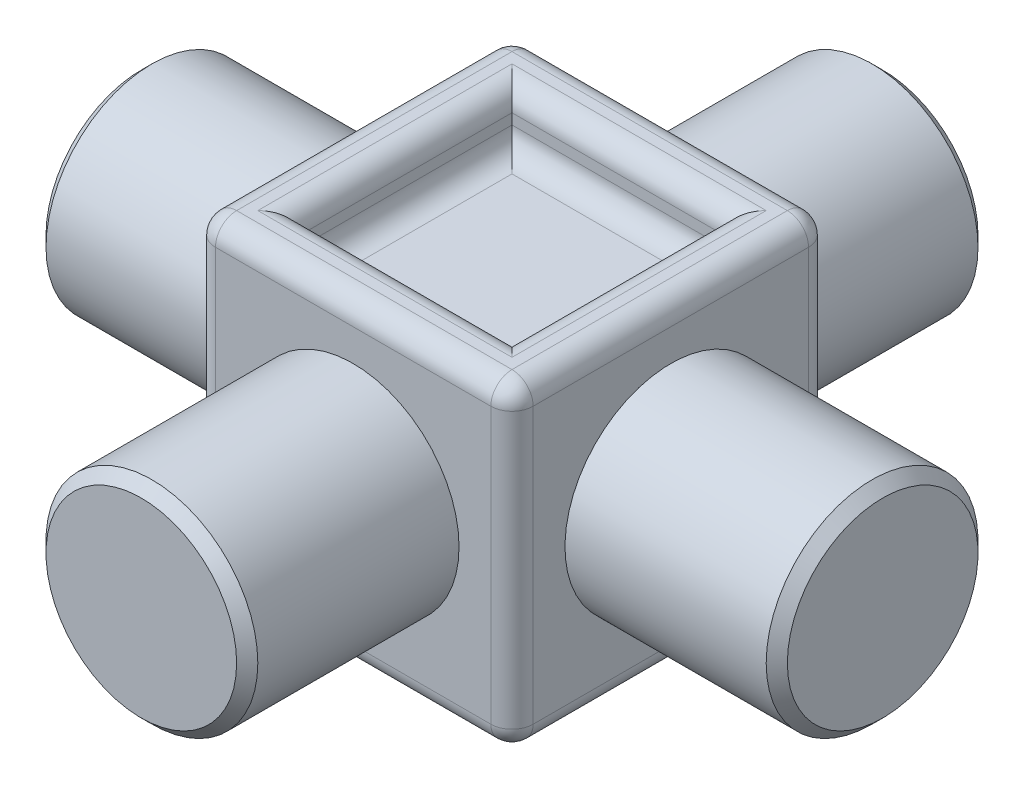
ISO-10303-21;
HEADER;
FILE_DESCRIPTION(('STEP AP214'),'2;1');
FILE_NAME('part.step','',(''),(''),'','','');
FILE_SCHEMA(('AUTOMOTIVE_DESIGN { 1 0 10303 214 1 1 1 1 }'));
ENDSEC;
DATA;
#1=APPLICATION_CONTEXT('core data for automotive mechanical design processes');
#2=APPLICATION_PROTOCOL_DEFINITION('international standard','automotive_design',2000,#1);
#3=PRODUCT_CONTEXT('',#1,'mechanical');
#4=PRODUCT('Part','Part','',(#3));
#5=PRODUCT_RELATED_PRODUCT_CATEGORY('part','',(#4));
#6=PRODUCT_DEFINITION_FORMATION('','',#4);
#7=PRODUCT_DEFINITION_CONTEXT('part definition',#1,'design');
#8=PRODUCT_DEFINITION('design','',#6,#7);
#9=PRODUCT_DEFINITION_SHAPE('','',#8);
#10=(LENGTH_UNIT() NAMED_UNIT(*) SI_UNIT(.MILLI.,.METRE.));
#11=(NAMED_UNIT(*) PLANE_ANGLE_UNIT() SI_UNIT($,.RADIAN.));
#12=(NAMED_UNIT(*) SI_UNIT($,.STERADIAN.) SOLID_ANGLE_UNIT());
#13=UNCERTAINTY_MEASURE_WITH_UNIT(LENGTH_MEASURE(1.E-05),#10,'distance_accuracy_value','');
#14=(GEOMETRIC_REPRESENTATION_CONTEXT(3) GLOBAL_UNCERTAINTY_ASSIGNED_CONTEXT((#13)) GLOBAL_UNIT_ASSIGNED_CONTEXT((#10,
#11,#12)) REPRESENTATION_CONTEXT('',''));
#15=CARTESIAN_POINT('',(0.,0.,0.));
#16=DIRECTION('',(0.,0.,1.));
#17=DIRECTION('',(1.,0.,0.));
#18=AXIS2_PLACEMENT_3D('',#15,#16,#17);
#19=CARTESIAN_POINT('',(-15.,15.,15.));
#20=DIRECTION('',(1.,0.,0.));
#21=DIRECTION('',(0.,1.,0.));
#22=AXIS2_PLACEMENT_3D('',#19,#20,#21);
#23=PLANE('',#22);
#24=CARTESIAN_POINT('',(-15.,0.,0.));
#25=DIRECTION('',(1.,0.,0.));
#26=DIRECTION('',(0.,1.,0.));
#27=AXIS2_PLACEMENT_3D('',#24,#25,#26);
#28=CIRCLE('',#27,10.);
#29=CARTESIAN_POINT('',(-15.,10.,0.));
#30=VERTEX_POINT('',#29);
#31=EDGE_CURVE('E243',#30,#30,#28,.F.);
#32=ORIENTED_EDGE('',*,*,#31,.F.);
#33=EDGE_LOOP('',(#32));
#34=FACE_BOUND('',#33,.T.);
#35=DIRECTION('',(0.,0.,-1.));
#36=VECTOR('',#35,1.);
#37=CARTESIAN_POINT('',(-15.,-13.,15.));
#38=LINE('',#37,#36);
#39=CARTESIAN_POINT('',(-15.,-13.,-13.));
#40=VERTEX_POINT('',#39);
#41=CARTESIAN_POINT('',(-15.,-13.,13.));
#42=VERTEX_POINT('',#41);
#43=EDGE_CURVE('E276',#40,#42,#38,.F.);
#44=ORIENTED_EDGE('',*,*,#43,.T.);
#45=DIRECTION('',(0.,-1.,0.));
#46=VECTOR('',#45,1.);
#47=CARTESIAN_POINT('',(-15.,13.,13.));
#48=LINE('',#47,#46);
#49=CARTESIAN_POINT('',(-15.,13.,13.));
#50=VERTEX_POINT('',#49);
#51=EDGE_CURVE('E436',#42,#50,#48,.F.);
#52=ORIENTED_EDGE('',*,*,#51,.T.);
#53=DIRECTION('',(0.,0.,-1.));
#54=VECTOR('',#53,1.);
#55=CARTESIAN_POINT('',(-15.,13.,15.));
#56=LINE('',#55,#54);
#57=CARTESIAN_POINT('',(-15.,13.,-13.));
#58=VERTEX_POINT('',#57);
#59=EDGE_CURVE('E279',#50,#58,#56,.T.);
#60=ORIENTED_EDGE('',*,*,#59,.T.);
#61=DIRECTION('',(0.,-1.,0.));
#62=VECTOR('',#61,1.);
#63=CARTESIAN_POINT('',(-15.,15.,-13.));
#64=LINE('',#63,#62);
#65=EDGE_CURVE('E434',#58,#40,#64,.T.);
#66=ORIENTED_EDGE('',*,*,#65,.T.);
#67=EDGE_LOOP('',(#44,#52,#60,#66));
#68=FACE_BOUND('',#67,.T.);
#69=ADVANCED_FACE('F34',(#34,#68),#23,.F.);
#70=CARTESIAN_POINT('',(-15.,-15.,15.));
#71=DIRECTION('',(0.,1.,0.));
#72=DIRECTION('',(0.,0.,1.));
#73=AXIS2_PLACEMENT_3D('',#70,#71,#72);
#74=PLANE('',#73);
#75=DIRECTION('',(1.,0.,0.));
#76=VECTOR('',#75,1.);
#77=CARTESIAN_POINT('',(-15.,-15.,13.));
#78=LINE('',#77,#76);
#79=CARTESIAN_POINT('',(13.,-15.,13.));
#80=VERTEX_POINT('',#79);
#81=CARTESIAN_POINT('',(-13.,-15.,13.));
#82=VERTEX_POINT('',#81);
#83=EDGE_CURVE('E326',#80,#82,#78,.F.);
#84=ORIENTED_EDGE('',*,*,#83,.T.);
#85=DIRECTION('',(0.,0.,-1.));
#86=VECTOR('',#85,1.);
#87=CARTESIAN_POINT('',(-13.,-15.,15.));
#88=LINE('',#87,#86);
#89=CARTESIAN_POINT('',(-13.,-15.,-13.));
#90=VERTEX_POINT('',#89);
#91=EDGE_CURVE('E329',#82,#90,#88,.T.);
#92=ORIENTED_EDGE('',*,*,#91,.T.);
#93=DIRECTION('',(1.,0.,0.));
#94=VECTOR('',#93,1.);
#95=CARTESIAN_POINT('',(-15.,-15.,-13.));
#96=LINE('',#95,#94);
#97=CARTESIAN_POINT('',(13.,-15.,-13.));
#98=VERTEX_POINT('',#97);
#99=EDGE_CURVE('E320',#90,#98,#96,.T.);
#100=ORIENTED_EDGE('',*,*,#99,.T.);
#101=DIRECTION('',(0.,0.,-1.));
#102=VECTOR('',#101,1.);
#103=CARTESIAN_POINT('',(13.,-15.,15.));
#104=LINE('',#103,#102);
#105=EDGE_CURVE('E323',#98,#80,#104,.F.);
#106=ORIENTED_EDGE('',*,*,#105,.T.);
#107=EDGE_LOOP('',(#84,#92,#100,#106));
#108=FACE_BOUND('',#107,.T.);
#109=DIRECTION('',(-1.,0.,0.));
#110=VECTOR('',#109,1.);
#111=CARTESIAN_POINT('',(-15.,-15.,12.));
#112=LINE('',#111,#110);
#113=CARTESIAN_POINT('',(-12.,-15.,12.));
#114=VERTEX_POINT('',#113);
#115=CARTESIAN_POINT('',(12.,-15.,12.));
#116=VERTEX_POINT('',#115);
#117=EDGE_CURVE('E315',#114,#116,#112,.F.);
#118=ORIENTED_EDGE('',*,*,#117,.T.);
#119=DIRECTION('',(0.,0.,1.));
#120=VECTOR('',#119,1.);
#121=CARTESIAN_POINT('',(12.,-15.,15.));
#122=LINE('',#121,#120);
#123=CARTESIAN_POINT('',(12.,-15.,-12.));
#124=VERTEX_POINT('',#123);
#125=EDGE_CURVE('E317',#116,#124,#122,.F.);
#126=ORIENTED_EDGE('',*,*,#125,.T.);
#127=DIRECTION('',(1.,0.,0.));
#128=VECTOR('',#127,1.);
#129=CARTESIAN_POINT('',(-15.,-15.,-12.));
#130=LINE('',#129,#128);
#131=CARTESIAN_POINT('',(-12.,-15.,-12.));
#132=VERTEX_POINT('',#131);
#133=EDGE_CURVE('E311',#124,#132,#130,.F.);
#134=ORIENTED_EDGE('',*,*,#133,.T.);
#135=DIRECTION('',(0.,0.,-1.));
#136=VECTOR('',#135,1.);
#137=CARTESIAN_POINT('',(-12.,-15.,15.));
#138=LINE('',#137,#136);
#139=EDGE_CURVE('E313',#132,#114,#138,.F.);
#140=ORIENTED_EDGE('',*,*,#139,.T.);
#141=EDGE_LOOP('',(#118,#126,#134,#140));
#142=FACE_BOUND('',#141,.T.);
#143=ADVANCED_FACE('F498',(#108,#142),#74,.F.);
#144=CARTESIAN_POINT('',(15.,15.,15.));
#145=DIRECTION('',(-1.,0.,0.));
#146=DIRECTION('',(0.,-1.,0.));
#147=AXIS2_PLACEMENT_3D('',#144,#145,#146);
#148=PLANE('',#147);
#149=CARTESIAN_POINT('',(15.,0.,0.));
#150=DIRECTION('',(-1.,0.,0.));
#151=DIRECTION('',(0.,-1.,0.));
#152=AXIS2_PLACEMENT_3D('',#149,#150,#151);
#153=CIRCLE('',#152,10.);
#154=CARTESIAN_POINT('',(15.,-10.,0.));
#155=VERTEX_POINT('',#154);
#156=EDGE_CURVE('E702',#155,#155,#153,.F.);
#157=ORIENTED_EDGE('',*,*,#156,.F.);
#158=EDGE_LOOP('',(#157));
#159=FACE_BOUND('',#158,.T.);
#160=DIRECTION('',(0.,0.,-1.));
#161=VECTOR('',#160,1.);
#162=CARTESIAN_POINT('',(15.,13.,15.));
#163=LINE('',#162,#161);
#164=CARTESIAN_POINT('',(15.,13.,-13.));
#165=VERTEX_POINT('',#164);
#166=CARTESIAN_POINT('',(15.,13.,13.));
#167=VERTEX_POINT('',#166);
#168=EDGE_CURVE('E267',#165,#167,#163,.F.);
#169=ORIENTED_EDGE('',*,*,#168,.T.);
#170=DIRECTION('',(0.,1.,0.));
#171=VECTOR('',#170,1.);
#172=CARTESIAN_POINT('',(15.,-13.,13.));
#173=LINE('',#172,#171);
#174=CARTESIAN_POINT('',(15.,-13.,13.));
#175=VERTEX_POINT('',#174);
#176=EDGE_CURVE('E440',#167,#175,#173,.F.);
#177=ORIENTED_EDGE('',*,*,#176,.T.);
#178=DIRECTION('',(0.,0.,-1.));
#179=VECTOR('',#178,1.);
#180=CARTESIAN_POINT('',(15.,-13.,15.));
#181=LINE('',#180,#179);
#182=CARTESIAN_POINT('',(15.,-13.,-13.));
#183=VERTEX_POINT('',#182);
#184=EDGE_CURVE('E264',#175,#183,#181,.T.);
#185=ORIENTED_EDGE('',*,*,#184,.T.);
#186=DIRECTION('',(0.,1.,0.));
#187=VECTOR('',#186,1.);
#188=CARTESIAN_POINT('',(15.,15.,-13.));
#189=LINE('',#188,#187);
#190=EDGE_CURVE('E438',#183,#165,#189,.T.);
#191=ORIENTED_EDGE('',*,*,#190,.T.);
#192=EDGE_LOOP('',(#169,#177,#185,#191));
#193=FACE_BOUND('',#192,.T.);
#194=ADVANCED_FACE('F504',(#159,#193),#148,.F.);
#195=CARTESIAN_POINT('',(-15.,15.,15.));
#196=DIRECTION('',(0.,-1.,0.));
#197=DIRECTION('',(0.,0.,-1.));
#198=AXIS2_PLACEMENT_3D('',#195,#196,#197);
#199=PLANE('',#198);
#200=DIRECTION('',(-1.,0.,0.));
#201=VECTOR('',#200,1.);
#202=CARTESIAN_POINT('',(15.,15.,13.));
#203=LINE('',#202,#201);
#204=CARTESIAN_POINT('',(-13.,15.,13.));
#205=VERTEX_POINT('',#204);
#206=CARTESIAN_POINT('',(13.,15.,13.));
#207=VERTEX_POINT('',#206);
#208=EDGE_CURVE('E258',#205,#207,#203,.F.);
#209=ORIENTED_EDGE('',*,*,#208,.T.);
#210=DIRECTION('',(0.,0.,-1.));
#211=VECTOR('',#210,1.);
#212=CARTESIAN_POINT('',(13.,15.,15.));
#213=LINE('',#212,#211);
#214=CARTESIAN_POINT('',(13.,15.,-13.));
#215=VERTEX_POINT('',#214);
#216=EDGE_CURVE('E261',#207,#215,#213,.T.);
#217=ORIENTED_EDGE('',*,*,#216,.T.);
#218=DIRECTION('',(-1.,0.,0.));
#219=VECTOR('',#218,1.);
#220=CARTESIAN_POINT('',(-15.,15.,-13.));
#221=LINE('',#220,#219);
#222=CARTESIAN_POINT('',(-13.,15.,-13.));
#223=VERTEX_POINT('',#222);
#224=EDGE_CURVE('E248',#215,#223,#221,.T.);
#225=ORIENTED_EDGE('',*,*,#224,.T.);
#226=DIRECTION('',(0.,0.,-1.));
#227=VECTOR('',#226,1.);
#228=CARTESIAN_POINT('',(-13.,15.,15.));
#229=LINE('',#228,#227);
#230=EDGE_CURVE('E251',#223,#205,#229,.F.);
#231=ORIENTED_EDGE('',*,*,#230,.T.);
#232=EDGE_LOOP('',(#209,#217,#225,#231));
#233=FACE_BOUND('',#232,.T.);
#234=DIRECTION('',(1.,0.,0.));
#235=VECTOR('',#234,1.);
#236=CARTESIAN_POINT('',(-15.,15.,12.));
#237=LINE('',#236,#235);
#238=CARTESIAN_POINT('',(12.,15.,12.));
#239=VERTEX_POINT('',#238);
#240=CARTESIAN_POINT('',(-12.,15.,12.));
#241=VERTEX_POINT('',#240);
#242=EDGE_CURVE('E247',#239,#241,#237,.F.);
#243=ORIENTED_EDGE('',*,*,#242,.T.);
#244=DIRECTION('',(0.,0.,1.));
#245=VECTOR('',#244,1.);
#246=CARTESIAN_POINT('',(-12.,15.,15.));
#247=LINE('',#246,#245);
#248=CARTESIAN_POINT('',(-12.,15.,-12.));
#249=VERTEX_POINT('',#248);
#250=EDGE_CURVE('E226',#241,#249,#247,.F.);
#251=ORIENTED_EDGE('',*,*,#250,.T.);
#252=DIRECTION('',(-1.,0.,0.));
#253=VECTOR('',#252,1.);
#254=CARTESIAN_POINT('',(-15.,15.,-12.));
#255=LINE('',#254,#253);
#256=CARTESIAN_POINT('',(12.,15.,-12.));
#257=VERTEX_POINT('',#256);
#258=EDGE_CURVE('E236',#249,#257,#255,.F.);
#259=ORIENTED_EDGE('',*,*,#258,.T.);
#260=DIRECTION('',(0.,0.,-1.));
#261=VECTOR('',#260,1.);
#262=CARTESIAN_POINT('',(12.,15.,15.));
#263=LINE('',#262,#261);
#264=EDGE_CURVE('E242',#257,#239,#263,.F.);
#265=ORIENTED_EDGE('',*,*,#264,.T.);
#266=EDGE_LOOP('',(#243,#251,#259,#265));
#267=FACE_BOUND('',#266,.T.);
#268=ADVANCED_FACE('F245',(#233,#267),#199,.F.);
#269=CARTESIAN_POINT('',(0.,0.,15.));
#270=DIRECTION('',(0.,0.,1.));
#271=DIRECTION('',(1.,0.,0.));
#272=AXIS2_PLACEMENT_3D('',#269,#270,#271);
#273=PLANE('',#272);
#274=CARTESIAN_POINT('',(0.,0.,15.));
#275=DIRECTION('',(0.,0.,1.));
#276=DIRECTION('',(1.,0.,0.));
#277=AXIS2_PLACEMENT_3D('',#274,#275,#276);
#278=CIRCLE('',#277,10.);
#279=CARTESIAN_POINT('',(10.,0.,15.));
#280=VERTEX_POINT('',#279);
#281=EDGE_CURVE('E780',#280,#280,#278,.F.);
#282=ORIENTED_EDGE('',*,*,#281,.T.);
#283=EDGE_LOOP('',(#282));
#284=FACE_BOUND('',#283,.T.);
#285=DIRECTION('',(-1.,0.,0.));
#286=VECTOR('',#285,1.);
#287=CARTESIAN_POINT('',(-15.,13.,15.));
#288=LINE('',#287,#286);
#289=CARTESIAN_POINT('',(13.,13.,15.));
#290=VERTEX_POINT('',#289);
#291=CARTESIAN_POINT('',(-13.,13.,15.));
#292=VERTEX_POINT('',#291);
#293=EDGE_CURVE('E273',#290,#292,#288,.T.);
#294=ORIENTED_EDGE('',*,*,#293,.T.);
#295=DIRECTION('',(0.,-1.,0.));
#296=VECTOR('',#295,1.);
#297=CARTESIAN_POINT('',(-13.,-13.,15.));
#298=LINE('',#297,#296);
#299=CARTESIAN_POINT('',(-13.,-13.,15.));
#300=VERTEX_POINT('',#299);
#301=EDGE_CURVE('E432',#292,#300,#298,.T.);
#302=ORIENTED_EDGE('',*,*,#301,.T.);
#303=DIRECTION('',(1.,0.,0.));
#304=VECTOR('',#303,1.);
#305=CARTESIAN_POINT('',(15.,-13.,15.));
#306=LINE('',#305,#304);
#307=CARTESIAN_POINT('',(13.,-13.,15.));
#308=VERTEX_POINT('',#307);
#309=EDGE_CURVE('E270',#300,#308,#306,.T.);
#310=ORIENTED_EDGE('',*,*,#309,.T.);
#311=DIRECTION('',(0.,1.,0.));
#312=VECTOR('',#311,1.);
#313=CARTESIAN_POINT('',(13.,13.,15.));
#314=LINE('',#313,#312);
#315=EDGE_CURVE('E430',#308,#290,#314,.T.);
#316=ORIENTED_EDGE('',*,*,#315,.T.);
#317=EDGE_LOOP('',(#294,#302,#310,#316));
#318=FACE_BOUND('',#317,.T.);
#319=ADVANCED_FACE('F686',(#284,#318),#273,.T.);
#320=CARTESIAN_POINT('',(0.,0.,-15.));
#321=DIRECTION('',(0.,0.,1.));
#322=DIRECTION('',(1.,0.,0.));
#323=AXIS2_PLACEMENT_3D('',#320,#321,#322);
#324=PLANE('',#323);
#325=CARTESIAN_POINT('',(0.,0.,-15.));
#326=DIRECTION('',(0.,0.,1.));
#327=DIRECTION('',(1.,0.,0.));
#328=AXIS2_PLACEMENT_3D('',#325,#326,#327);
#329=CIRCLE('',#328,10.);
#330=CARTESIAN_POINT('',(10.,0.,-15.));
#331=VERTEX_POINT('',#330);
#332=EDGE_CURVE('E793',#331,#331,#329,.F.);
#333=ORIENTED_EDGE('',*,*,#332,.F.);
#334=EDGE_LOOP('',(#333));
#335=FACE_BOUND('',#334,.T.);
#336=DIRECTION('',(-1.,0.,0.));
#337=VECTOR('',#336,1.);
#338=CARTESIAN_POINT('',(0.,13.,-15.));
#339=LINE('',#338,#337);
#340=CARTESIAN_POINT('',(-13.,13.,-15.));
#341=VERTEX_POINT('',#340);
#342=CARTESIAN_POINT('',(13.,13.,-15.));
#343=VERTEX_POINT('',#342);
#344=EDGE_CURVE('E284',#341,#343,#339,.F.);
#345=ORIENTED_EDGE('',*,*,#344,.T.);
#346=DIRECTION('',(0.,1.,0.));
#347=VECTOR('',#346,1.);
#348=CARTESIAN_POINT('',(13.,0.,-15.));
#349=LINE('',#348,#347);
#350=CARTESIAN_POINT('',(13.,-13.,-15.));
#351=VERTEX_POINT('',#350);
#352=EDGE_CURVE('E443',#343,#351,#349,.F.);
#353=ORIENTED_EDGE('',*,*,#352,.T.);
#354=DIRECTION('',(1.,0.,0.));
#355=VECTOR('',#354,1.);
#356=CARTESIAN_POINT('',(0.,-13.,-15.));
#357=LINE('',#356,#355);
#358=CARTESIAN_POINT('',(-13.,-13.,-15.));
#359=VERTEX_POINT('',#358);
#360=EDGE_CURVE('E282',#351,#359,#357,.F.);
#361=ORIENTED_EDGE('',*,*,#360,.T.);
#362=DIRECTION('',(0.,-1.,0.));
#363=VECTOR('',#362,1.);
#364=CARTESIAN_POINT('',(-13.,0.,-15.));
#365=LINE('',#364,#363);
#366=EDGE_CURVE('E56',#359,#341,#365,.F.);
#367=ORIENTED_EDGE('',*,*,#366,.T.);
#368=EDGE_LOOP('',(#345,#353,#361,#367));
#369=FACE_BOUND('',#368,.T.);
#370=ADVANCED_FACE('F683',(#335,#369),#324,.F.);
#371=CARTESIAN_POINT('',(0.,0.,-35.));
#372=DIRECTION('',(0.,0.,1.));
#373=DIRECTION('',(1.,0.,0.));
#374=AXIS2_PLACEMENT_3D('',#371,#372,#373);
#375=PLANE('',#374);
#376=CARTESIAN_POINT('',(0.,0.,-35.));
#377=DIRECTION('',(0.,0.,1.));
#378=DIRECTION('',(1.,0.,0.));
#379=AXIS2_PLACEMENT_3D('',#376,#377,#378);
#380=CIRCLE('',#379,9.00000000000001);
#381=CARTESIAN_POINT('',(9.00000000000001,0.,-35.));
#382=VERTEX_POINT('',#381);
#383=EDGE_CURVE('E481',#382,#382,#380,.F.);
#384=ORIENTED_EDGE('',*,*,#383,.T.);
#385=EDGE_LOOP('',(#384));
#386=FACE_BOUND('',#385,.T.);
#387=ADVANCED_FACE('F681',(#386),#375,.F.);
#388=CARTESIAN_POINT('',(0.,0.,35.));
#389=DIRECTION('',(0.,0.,-1.));
#390=DIRECTION('',(-1.,0.,0.));
#391=AXIS2_PLACEMENT_3D('',#388,#389,#390);
#392=CYLINDRICAL_SURFACE('',#391,10.);
#393=CARTESIAN_POINT('',(0.,0.,-34.));
#394=DIRECTION('',(0.,0.,1.));
#395=DIRECTION('',(1.,0.,0.));
#396=AXIS2_PLACEMENT_3D('',#393,#394,#395);
#397=CIRCLE('',#396,10.);
#398=CARTESIAN_POINT('',(10.,0.,-34.));
#399=VERTEX_POINT('',#398);
#400=EDGE_CURVE('E478',#399,#399,#397,.T.);
#401=ORIENTED_EDGE('',*,*,#400,.T.);
#402=EDGE_LOOP('',(#401));
#403=FACE_BOUND('',#402,.T.);
#404=ORIENTED_EDGE('',*,*,#332,.T.);
#405=EDGE_LOOP('',(#404));
#406=FACE_BOUND('',#405,.T.);
#407=ADVANCED_FACE('F675',(#403,#406),#392,.T.);
#408=CARTESIAN_POINT('',(0.,0.,34.));
#409=DIRECTION('',(0.,0.,1.));
#410=DIRECTION('',(1.,0.,0.));
#411=AXIS2_PLACEMENT_3D('',#408,#409,#410);
#412=CIRCLE('',#411,10.);
#413=CARTESIAN_POINT('',(10.,0.,34.));
#414=VERTEX_POINT('',#413);
#415=EDGE_CURVE('E475',#414,#414,#412,.F.);
#416=ORIENTED_EDGE('',*,*,#415,.T.);
#417=EDGE_LOOP('',(#416));
#418=FACE_BOUND('',#417,.T.);
#419=ORIENTED_EDGE('',*,*,#281,.F.);
#420=EDGE_LOOP('',(#419));
#421=FACE_BOUND('',#420,.T.);
#422=ADVANCED_FACE('F666',(#418,#421),#392,.T.);
#423=CARTESIAN_POINT('',(0.,0.,35.));
#424=DIRECTION('',(0.,0.,1.));
#425=DIRECTION('',(1.,0.,0.));
#426=AXIS2_PLACEMENT_3D('',#423,#424,#425);
#427=PLANE('',#426);
#428=CARTESIAN_POINT('',(0.,0.,35.));
#429=DIRECTION('',(0.,0.,1.));
#430=DIRECTION('',(1.,0.,0.));
#431=AXIS2_PLACEMENT_3D('',#428,#429,#430);
#432=CIRCLE('',#431,9.00000000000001);
#433=CARTESIAN_POINT('',(9.00000000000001,0.,35.));
#434=VERTEX_POINT('',#433);
#435=EDGE_CURVE('E472',#434,#434,#432,.T.);
#436=ORIENTED_EDGE('',*,*,#435,.T.);
#437=EDGE_LOOP('',(#436));
#438=FACE_BOUND('',#437,.T.);
#439=ADVANCED_FACE('F663',(#438),#427,.T.);
#440=CARTESIAN_POINT('',(35.,0.,1.2220184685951E-13));
#441=DIRECTION('',(-1.,0.,0.));
#442=DIRECTION('',(0.,0.,1.));
#443=AXIS2_PLACEMENT_3D('',#440,#441,#442);
#444=PLANE('',#443);
#445=CARTESIAN_POINT('',(35.,0.,1.2220184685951E-13));
#446=DIRECTION('',(-1.,0.,0.));
#447=DIRECTION('',(0.,0.,1.));
#448=AXIS2_PLACEMENT_3D('',#445,#446,#447);
#449=CIRCLE('',#448,9.00000000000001);
#450=CARTESIAN_POINT('',(35.,0.,9.00000000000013));
#451=VERTEX_POINT('',#450);
#452=EDGE_CURVE('E469',#451,#451,#449,.F.);
#453=ORIENTED_EDGE('',*,*,#452,.T.);
#454=EDGE_LOOP('',(#453));
#455=FACE_BOUND('',#454,.T.);
#456=ADVANCED_FACE('F665',(#455),#444,.F.);
#457=CARTESIAN_POINT('',(-35.,0.,-1.2220184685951E-13));
#458=DIRECTION('',(1.,0.,0.));
#459=DIRECTION('',(0.,0.,-1.));
#460=AXIS2_PLACEMENT_3D('',#457,#458,#459);
#461=CYLINDRICAL_SURFACE('',#460,10.);
#462=CARTESIAN_POINT('',(34.,0.,1.18710365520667E-13));
#463=DIRECTION('',(-1.,0.,0.));
#464=DIRECTION('',(0.,0.,1.));
#465=AXIS2_PLACEMENT_3D('',#462,#463,#464);
#466=CIRCLE('',#465,10.);
#467=CARTESIAN_POINT('',(34.,0.,10.0000000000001));
#468=VERTEX_POINT('',#467);
#469=EDGE_CURVE('E445',#468,#468,#466,.T.);
#470=ORIENTED_EDGE('',*,*,#469,.T.);
#471=EDGE_LOOP('',(#470));
#472=FACE_BOUND('',#471,.T.);
#473=ORIENTED_EDGE('',*,*,#156,.T.);
#474=EDGE_LOOP('',(#473));
#475=FACE_BOUND('',#474,.T.);
#476=ADVANCED_FACE('F672',(#472,#475),#461,.T.);
#477=CARTESIAN_POINT('',(-34.,0.,-1.18710365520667E-13));
#478=DIRECTION('',(-1.,0.,0.));
#479=DIRECTION('',(0.,0.,1.));
#480=AXIS2_PLACEMENT_3D('',#477,#478,#479);
#481=CIRCLE('',#480,10.);
#482=CARTESIAN_POINT('',(-34.,0.,9.99999999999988));
#483=VERTEX_POINT('',#482);
#484=EDGE_CURVE('E11',#483,#483,#481,.F.);
#485=ORIENTED_EDGE('',*,*,#484,.T.);
#486=EDGE_LOOP('',(#485));
#487=FACE_BOUND('',#486,.T.);
#488=ORIENTED_EDGE('',*,*,#31,.T.);
#489=EDGE_LOOP('',(#488));
#490=FACE_BOUND('',#489,.T.);
#491=ADVANCED_FACE('F680',(#487,#490),#461,.T.);
#492=CARTESIAN_POINT('',(-35.,0.,-1.2220184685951E-13));
#493=DIRECTION('',(-1.,0.,0.));
#494=DIRECTION('',(0.,0.,1.));
#495=AXIS2_PLACEMENT_3D('',#492,#493,#494);
#496=PLANE('',#495);
#497=CARTESIAN_POINT('',(-35.,0.,-1.2220184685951E-13));
#498=DIRECTION('',(-1.,0.,0.));
#499=DIRECTION('',(0.,0.,1.));
#500=AXIS2_PLACEMENT_3D('',#497,#498,#499);
#501=CIRCLE('',#500,9.);
#502=CARTESIAN_POINT('',(-35.,0.,8.99999999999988));
#503=VERTEX_POINT('',#502);
#504=EDGE_CURVE('E42',#503,#503,#501,.T.);
#505=ORIENTED_EDGE('',*,*,#504,.T.);
#506=EDGE_LOOP('',(#505));
#507=FACE_BOUND('',#506,.T.);
#508=ADVANCED_FACE('F486',(#507),#496,.T.);
#509=CARTESIAN_POINT('',(10.,10.,10.));
#510=DIRECTION('',(1.,0.,0.));
#511=DIRECTION('',(0.,0.,-1.));
#512=AXIS2_PLACEMENT_3D('',#509,#510,#511);
#513=PLANE('',#512);
#514=DIRECTION('',(0.,1.,0.));
#515=VECTOR('',#514,1.);
#516=CARTESIAN_POINT('',(10.,10.,10.));
#517=LINE('',#516,#515);
#518=CARTESIAN_POINT('',(10.,12.,10.));
#519=VERTEX_POINT('',#518);
#520=CARTESIAN_POINT('',(10.,13.,10.));
#521=VERTEX_POINT('',#520);
#522=EDGE_CURVE('E777',#519,#521,#517,.T.);
#523=ORIENTED_EDGE('',*,*,#522,.T.);
#524=DIRECTION('',(0.,0.,-1.));
#525=VECTOR('',#524,1.);
#526=CARTESIAN_POINT('',(10.,13.,10.));
#527=LINE('',#526,#525);
#528=CARTESIAN_POINT('',(10.,13.,-10.));
#529=VERTEX_POINT('',#528);
#530=EDGE_CURVE('E296',#521,#529,#527,.T.);
#531=ORIENTED_EDGE('',*,*,#530,.T.);
#532=DIRECTION('',(0.,1.,0.));
#533=VECTOR('',#532,1.);
#534=CARTESIAN_POINT('',(10.,10.,-10.));
#535=LINE('',#534,#533);
#536=CARTESIAN_POINT('',(10.,12.,-10.));
#537=VERTEX_POINT('',#536);
#538=EDGE_CURVE('E771',#537,#529,#535,.T.);
#539=ORIENTED_EDGE('',*,*,#538,.F.);
#540=DIRECTION('',(0.,0.,-1.));
#541=VECTOR('',#540,1.);
#542=CARTESIAN_POINT('',(10.,12.,10.));
#543=LINE('',#542,#541);
#544=EDGE_CURVE('E294',#537,#519,#543,.F.);
#545=ORIENTED_EDGE('',*,*,#544,.T.);
#546=EDGE_LOOP('',(#523,#531,#539,#545));
#547=FACE_BOUND('',#546,.T.);
#548=ADVANCED_FACE('F824',(#547),#513,.F.);
#549=CARTESIAN_POINT('',(-10.,10.,10.));
#550=DIRECTION('',(0.,0.,1.));
#551=DIRECTION('',(1.,0.,0.));
#552=AXIS2_PLACEMENT_3D('',#549,#550,#551);
#553=PLANE('',#552);
#554=DIRECTION('',(0.,1.,0.));
#555=VECTOR('',#554,1.);
#556=CARTESIAN_POINT('',(-10.,10.,10.));
#557=LINE('',#556,#555);
#558=CARTESIAN_POINT('',(-10.,12.,10.));
#559=VERTEX_POINT('',#558);
#560=CARTESIAN_POINT('',(-10.,13.,10.));
#561=VERTEX_POINT('',#560);
#562=EDGE_CURVE('E781',#559,#561,#557,.T.);
#563=ORIENTED_EDGE('',*,*,#562,.T.);
#564=DIRECTION('',(1.,0.,0.));
#565=VECTOR('',#564,1.);
#566=CARTESIAN_POINT('',(-10.,13.,10.));
#567=LINE('',#566,#565);
#568=EDGE_CURVE('E292',#561,#521,#567,.T.);
#569=ORIENTED_EDGE('',*,*,#568,.T.);
#570=ORIENTED_EDGE('',*,*,#522,.F.);
#571=DIRECTION('',(1.,0.,0.));
#572=VECTOR('',#571,1.);
#573=CARTESIAN_POINT('',(-10.,12.,10.));
#574=LINE('',#573,#572);
#575=EDGE_CURVE('E289',#519,#559,#574,.F.);
#576=ORIENTED_EDGE('',*,*,#575,.T.);
#577=EDGE_LOOP('',(#563,#569,#570,#576));
#578=FACE_BOUND('',#577,.T.);
#579=ADVANCED_FACE('F805',(#578),#553,.F.);
#580=CARTESIAN_POINT('',(-10.,10.,-10.));
#581=DIRECTION('',(-1.,0.,0.));
#582=DIRECTION('',(0.,0.,1.));
#583=AXIS2_PLACEMENT_3D('',#580,#581,#582);
#584=PLANE('',#583);
#585=DIRECTION('',(0.,1.,0.));
#586=VECTOR('',#585,1.);
#587=CARTESIAN_POINT('',(-10.,10.,-10.));
#588=LINE('',#587,#586);
#589=CARTESIAN_POINT('',(-10.,12.,-10.));
#590=VERTEX_POINT('',#589);
#591=CARTESIAN_POINT('',(-10.,13.,-10.));
#592=VERTEX_POINT('',#591);
#593=EDGE_CURVE('E784',#590,#592,#588,.T.);
#594=ORIENTED_EDGE('',*,*,#593,.T.);
#595=DIRECTION('',(0.,0.,1.));
#596=VECTOR('',#595,1.);
#597=CARTESIAN_POINT('',(-10.,13.,-10.));
#598=LINE('',#597,#596);
#599=EDGE_CURVE('E229',#592,#561,#598,.T.);
#600=ORIENTED_EDGE('',*,*,#599,.T.);
#601=ORIENTED_EDGE('',*,*,#562,.F.);
#602=DIRECTION('',(0.,0.,1.));
#603=VECTOR('',#602,1.);
#604=CARTESIAN_POINT('',(-10.,12.,-10.));
#605=LINE('',#604,#603);
#606=EDGE_CURVE('E286',#559,#590,#605,.F.);
#607=ORIENTED_EDGE('',*,*,#606,.T.);
#608=EDGE_LOOP('',(#594,#600,#601,#607));
#609=FACE_BOUND('',#608,.T.);
#610=ADVANCED_FACE('F803',(#609),#584,.F.);
#611=CARTESIAN_POINT('',(10.,10.,-10.));
#612=DIRECTION('',(0.,0.,-1.));
#613=DIRECTION('',(-1.,0.,0.));
#614=AXIS2_PLACEMENT_3D('',#611,#612,#613);
#615=PLANE('',#614);
#616=ORIENTED_EDGE('',*,*,#538,.T.);
#617=DIRECTION('',(-1.,0.,0.));
#618=VECTOR('',#617,1.);
#619=CARTESIAN_POINT('',(10.,13.,-10.));
#620=LINE('',#619,#618);
#621=EDGE_CURVE('E300',#529,#592,#620,.T.);
#622=ORIENTED_EDGE('',*,*,#621,.T.);
#623=ORIENTED_EDGE('',*,*,#593,.F.);
#624=DIRECTION('',(-1.,0.,0.));
#625=VECTOR('',#624,1.);
#626=CARTESIAN_POINT('',(10.,12.,-10.));
#627=LINE('',#626,#625);
#628=EDGE_CURVE('E298',#590,#537,#627,.F.);
#629=ORIENTED_EDGE('',*,*,#628,.T.);
#630=EDGE_LOOP('',(#616,#622,#623,#629));
#631=FACE_BOUND('',#630,.T.);
#632=ADVANCED_FACE('F821',(#631),#615,.F.);
#633=CARTESIAN_POINT('',(0.,10.,0.));
#634=DIRECTION('',(0.,1.,0.));
#635=DIRECTION('',(0.,0.,1.));
#636=AXIS2_PLACEMENT_3D('',#633,#634,#635);
#637=PLANE('',#636);
#638=DIRECTION('',(0.,0.,1.));
#639=VECTOR('',#638,1.);
#640=CARTESIAN_POINT('',(-8.,10.,0.));
#641=LINE('',#640,#639);
#642=CARTESIAN_POINT('',(-8.,10.,-8.));
#643=VERTEX_POINT('',#642);
#644=CARTESIAN_POINT('',(-8.,10.,8.));
#645=VERTEX_POINT('',#644);
#646=EDGE_CURVE('E306',#643,#645,#641,.T.);
#647=ORIENTED_EDGE('',*,*,#646,.T.);
#648=DIRECTION('',(1.,0.,0.));
#649=VECTOR('',#648,1.);
#650=CARTESIAN_POINT('',(0.,10.,8.));
#651=LINE('',#650,#649);
#652=CARTESIAN_POINT('',(8.,10.,8.));
#653=VERTEX_POINT('',#652);
#654=EDGE_CURVE('E308',#645,#653,#651,.T.);
#655=ORIENTED_EDGE('',*,*,#654,.T.);
#656=DIRECTION('',(0.,0.,-1.));
#657=VECTOR('',#656,1.);
#658=CARTESIAN_POINT('',(8.,10.,0.));
#659=LINE('',#658,#657);
#660=CARTESIAN_POINT('',(8.,10.,-8.));
#661=VERTEX_POINT('',#660);
#662=EDGE_CURVE('E302',#653,#661,#659,.T.);
#663=ORIENTED_EDGE('',*,*,#662,.T.);
#664=DIRECTION('',(-1.,0.,0.));
#665=VECTOR('',#664,1.);
#666=CARTESIAN_POINT('',(0.,10.,-8.));
#667=LINE('',#666,#665);
#668=EDGE_CURVE('E304',#661,#643,#667,.T.);
#669=ORIENTED_EDGE('',*,*,#668,.T.);
#670=EDGE_LOOP('',(#647,#655,#663,#669));
#671=FACE_BOUND('',#670,.T.);
#672=ADVANCED_FACE('F816',(#671),#637,.T.);
#673=CARTESIAN_POINT('',(-10.,-10.,10.));
#674=DIRECTION('',(-1.,0.,0.));
#675=DIRECTION('',(0.,0.,1.));
#676=AXIS2_PLACEMENT_3D('',#673,#674,#675);
#677=PLANE('',#676);
#678=DIRECTION('',(0.,-1.,0.));
#679=VECTOR('',#678,1.);
#680=CARTESIAN_POINT('',(-10.,-10.,10.));
#681=LINE('',#680,#679);
#682=CARTESIAN_POINT('',(-10.,-12.,10.));
#683=VERTEX_POINT('',#682);
#684=CARTESIAN_POINT('',(-10.,-13.,10.));
#685=VERTEX_POINT('',#684);
#686=EDGE_CURVE('E769',#683,#685,#681,.T.);
#687=ORIENTED_EDGE('',*,*,#686,.T.);
#688=DIRECTION('',(0.,0.,-1.));
#689=VECTOR('',#688,1.);
#690=CARTESIAN_POINT('',(-10.,-13.,10.));
#691=LINE('',#690,#689);
#692=CARTESIAN_POINT('',(-10.,-13.,-10.));
#693=VERTEX_POINT('',#692);
#694=EDGE_CURVE('E344',#685,#693,#691,.T.);
#695=ORIENTED_EDGE('',*,*,#694,.T.);
#696=DIRECTION('',(0.,-1.,0.));
#697=VECTOR('',#696,1.);
#698=CARTESIAN_POINT('',(-10.,-10.,-10.));
#699=LINE('',#698,#697);
#700=CARTESIAN_POINT('',(-10.,-12.,-10.));
#701=VERTEX_POINT('',#700);
#702=EDGE_CURVE('E365',#701,#693,#699,.T.);
#703=ORIENTED_EDGE('',*,*,#702,.F.);
#704=DIRECTION('',(0.,0.,-1.));
#705=VECTOR('',#704,1.);
#706=CARTESIAN_POINT('',(-10.,-12.,10.));
#707=LINE('',#706,#705);
#708=EDGE_CURVE('E342',#701,#683,#707,.F.);
#709=ORIENTED_EDGE('',*,*,#708,.T.);
#710=EDGE_LOOP('',(#687,#695,#703,#709));
#711=FACE_BOUND('',#710,.T.);
#712=ADVANCED_FACE('F840',(#711),#677,.F.);
#713=CARTESIAN_POINT('',(10.,-10.,10.));
#714=DIRECTION('',(0.,0.,1.));
#715=DIRECTION('',(1.,0.,0.));
#716=AXIS2_PLACEMENT_3D('',#713,#714,#715);
#717=PLANE('',#716);
#718=DIRECTION('',(0.,-1.,0.));
#719=VECTOR('',#718,1.);
#720=CARTESIAN_POINT('',(10.,-10.,10.));
#721=LINE('',#720,#719);
#722=CARTESIAN_POINT('',(10.,-12.,10.));
#723=VERTEX_POINT('',#722);
#724=CARTESIAN_POINT('',(10.,-13.,10.));
#725=VERTEX_POINT('',#724);
#726=EDGE_CURVE('E764',#723,#725,#721,.T.);
#727=ORIENTED_EDGE('',*,*,#726,.T.);
#728=DIRECTION('',(-1.,0.,0.));
#729=VECTOR('',#728,1.);
#730=CARTESIAN_POINT('',(10.,-13.,10.));
#731=LINE('',#730,#729);
#732=EDGE_CURVE('E340',#725,#685,#731,.T.);
#733=ORIENTED_EDGE('',*,*,#732,.T.);
#734=ORIENTED_EDGE('',*,*,#686,.F.);
#735=DIRECTION('',(-1.,0.,0.));
#736=VECTOR('',#735,1.);
#737=CARTESIAN_POINT('',(10.,-12.,10.));
#738=LINE('',#737,#736);
#739=EDGE_CURVE('E337',#683,#723,#738,.F.);
#740=ORIENTED_EDGE('',*,*,#739,.T.);
#741=EDGE_LOOP('',(#727,#733,#734,#740));
#742=FACE_BOUND('',#741,.T.);
#743=ADVANCED_FACE('F767',(#742),#717,.F.);
#744=CARTESIAN_POINT('',(10.,-10.,-10.));
#745=DIRECTION('',(1.,0.,0.));
#746=DIRECTION('',(0.,0.,-1.));
#747=AXIS2_PLACEMENT_3D('',#744,#745,#746);
#748=PLANE('',#747);
#749=DIRECTION('',(0.,-1.,0.));
#750=VECTOR('',#749,1.);
#751=CARTESIAN_POINT('',(10.,-10.,-10.));
#752=LINE('',#751,#750);
#753=CARTESIAN_POINT('',(10.,-12.,-10.));
#754=VERTEX_POINT('',#753);
#755=CARTESIAN_POINT('',(10.,-13.,-10.));
#756=VERTEX_POINT('',#755);
#757=EDGE_CURVE('E766',#754,#756,#752,.T.);
#758=ORIENTED_EDGE('',*,*,#757,.T.);
#759=DIRECTION('',(0.,0.,1.));
#760=VECTOR('',#759,1.);
#761=CARTESIAN_POINT('',(10.,-13.,-10.));
#762=LINE('',#761,#760);
#763=EDGE_CURVE('E334',#756,#725,#762,.T.);
#764=ORIENTED_EDGE('',*,*,#763,.T.);
#765=ORIENTED_EDGE('',*,*,#726,.F.);
#766=DIRECTION('',(0.,0.,1.));
#767=VECTOR('',#766,1.);
#768=CARTESIAN_POINT('',(10.,-12.,-10.));
#769=LINE('',#768,#767);
#770=EDGE_CURVE('E332',#723,#754,#769,.F.);
#771=ORIENTED_EDGE('',*,*,#770,.T.);
#772=EDGE_LOOP('',(#758,#764,#765,#771));
#773=FACE_BOUND('',#772,.T.);
#774=ADVANCED_FACE('F763',(#773),#748,.F.);
#775=CARTESIAN_POINT('',(-10.,-10.,-10.));
#776=DIRECTION('',(0.,0.,-1.));
#777=DIRECTION('',(-1.,0.,0.));
#778=AXIS2_PLACEMENT_3D('',#775,#776,#777);
#779=PLANE('',#778);
#780=ORIENTED_EDGE('',*,*,#702,.T.);
#781=DIRECTION('',(1.,0.,0.));
#782=VECTOR('',#781,1.);
#783=CARTESIAN_POINT('',(-10.,-13.,-10.));
#784=LINE('',#783,#782);
#785=EDGE_CURVE('E348',#693,#756,#784,.T.);
#786=ORIENTED_EDGE('',*,*,#785,.T.);
#787=ORIENTED_EDGE('',*,*,#757,.F.);
#788=DIRECTION('',(1.,0.,0.));
#789=VECTOR('',#788,1.);
#790=CARTESIAN_POINT('',(-10.,-12.,-10.));
#791=LINE('',#790,#789);
#792=EDGE_CURVE('E346',#754,#701,#791,.F.);
#793=ORIENTED_EDGE('',*,*,#792,.T.);
#794=EDGE_LOOP('',(#780,#786,#787,#793));
#795=FACE_BOUND('',#794,.T.);
#796=ADVANCED_FACE('F844',(#795),#779,.F.);
#797=CARTESIAN_POINT('',(0.,-10.,0.));
#798=DIRECTION('',(0.,-1.,0.));
#799=DIRECTION('',(0.,0.,-1.));
#800=AXIS2_PLACEMENT_3D('',#797,#798,#799);
#801=PLANE('',#800);
#802=DIRECTION('',(0.,0.,1.));
#803=VECTOR('',#802,1.);
#804=CARTESIAN_POINT('',(8.,-10.,0.));
#805=LINE('',#804,#803);
#806=CARTESIAN_POINT('',(8.,-10.,-8.));
#807=VERTEX_POINT('',#806);
#808=CARTESIAN_POINT('',(8.,-10.,8.));
#809=VERTEX_POINT('',#808);
#810=EDGE_CURVE('E354',#807,#809,#805,.T.);
#811=ORIENTED_EDGE('',*,*,#810,.T.);
#812=DIRECTION('',(-1.,0.,0.));
#813=VECTOR('',#812,1.);
#814=CARTESIAN_POINT('',(0.,-10.,8.));
#815=LINE('',#814,#813);
#816=CARTESIAN_POINT('',(-8.,-10.,8.));
#817=VERTEX_POINT('',#816);
#818=EDGE_CURVE('E356',#809,#817,#815,.T.);
#819=ORIENTED_EDGE('',*,*,#818,.T.);
#820=DIRECTION('',(0.,0.,-1.));
#821=VECTOR('',#820,1.);
#822=CARTESIAN_POINT('',(-8.,-10.,0.));
#823=LINE('',#822,#821);
#824=CARTESIAN_POINT('',(-8.,-10.,-8.));
#825=VERTEX_POINT('',#824);
#826=EDGE_CURVE('E350',#817,#825,#823,.T.);
#827=ORIENTED_EDGE('',*,*,#826,.T.);
#828=DIRECTION('',(1.,0.,0.));
#829=VECTOR('',#828,1.);
#830=CARTESIAN_POINT('',(0.,-10.,-8.));
#831=LINE('',#830,#829);
#832=EDGE_CURVE('E352',#825,#807,#831,.T.);
#833=ORIENTED_EDGE('',*,*,#832,.T.);
#834=EDGE_LOOP('',(#811,#819,#827,#833));
#835=FACE_BOUND('',#834,.T.);
#836=ADVANCED_FACE('F526',(#835),#801,.T.);
#837=CARTESIAN_POINT('',(-13.,13.,15.));
#838=DIRECTION('',(0.,0.,-1.));
#839=DIRECTION('',(-1.,0.,0.));
#840=AXIS2_PLACEMENT_3D('',#837,#838,#839);
#841=CYLINDRICAL_SURFACE('',#840,2.);
#842=ORIENTED_EDGE('',*,*,#59,.F.);
#843=CARTESIAN_POINT('',(-13.,13.,13.));
#844=DIRECTION('',(0.,0.,-1.));
#845=DIRECTION('',(-1.,0.,0.));
#846=AXIS2_PLACEMENT_3D('',#843,#844,#845);
#847=CIRCLE('',#846,2.);
#848=EDGE_CURVE('E402',#50,#205,#847,.T.);
#849=ORIENTED_EDGE('',*,*,#848,.T.);
#850=ORIENTED_EDGE('',*,*,#230,.F.);
#851=CARTESIAN_POINT('',(-13.,13.,-13.));
#852=DIRECTION('',(0.,0.,-1.));
#853=DIRECTION('',(-1.,0.,0.));
#854=AXIS2_PLACEMENT_3D('',#851,#852,#853);
#855=CIRCLE('',#854,2.);
#856=EDGE_CURVE('E400',#223,#58,#855,.F.);
#857=ORIENTED_EDGE('',*,*,#856,.T.);
#858=EDGE_LOOP('',(#842,#849,#850,#857));
#859=FACE_BOUND('',#858,.T.);
#860=ADVANCED_FACE('F522',(#859),#841,.T.);
#861=CARTESIAN_POINT('',(0.,13.,13.));
#862=DIRECTION('',(1.,0.,0.));
#863=DIRECTION('',(0.,0.,-1.));
#864=AXIS2_PLACEMENT_3D('',#861,#862,#863);
#865=CYLINDRICAL_SURFACE('',#864,2.);
#866=ORIENTED_EDGE('',*,*,#208,.F.);
#867=CARTESIAN_POINT('',(-13.,13.,13.));
#868=DIRECTION('',(1.,0.,0.));
#869=DIRECTION('',(0.,0.,-1.));
#870=AXIS2_PLACEMENT_3D('',#867,#868,#869);
#871=CIRCLE('',#870,2.);
#872=EDGE_CURVE('E397',#205,#292,#871,.T.);
#873=ORIENTED_EDGE('',*,*,#872,.T.);
#874=ORIENTED_EDGE('',*,*,#293,.F.);
#875=CARTESIAN_POINT('',(13.,13.,13.));
#876=DIRECTION('',(1.,0.,0.));
#877=DIRECTION('',(0.,0.,-1.));
#878=AXIS2_PLACEMENT_3D('',#875,#876,#877);
#879=CIRCLE('',#878,2.);
#880=EDGE_CURVE('E359',#290,#207,#879,.F.);
#881=ORIENTED_EDGE('',*,*,#880,.T.);
#882=EDGE_LOOP('',(#866,#873,#874,#881));
#883=FACE_BOUND('',#882,.T.);
#884=ADVANCED_FACE('F519',(#883),#865,.T.);
#885=CARTESIAN_POINT('',(-15.,13.,-13.));
#886=DIRECTION('',(-1.,0.,0.));
#887=DIRECTION('',(0.,0.,1.));
#888=AXIS2_PLACEMENT_3D('',#885,#886,#887);
#889=CYLINDRICAL_SURFACE('',#888,2.);
#890=ORIENTED_EDGE('',*,*,#224,.F.);
#891=CARTESIAN_POINT('',(13.,13.,-13.));
#892=DIRECTION('',(-1.,0.,0.));
#893=DIRECTION('',(0.,0.,1.));
#894=AXIS2_PLACEMENT_3D('',#891,#892,#893);
#895=CIRCLE('',#894,2.);
#896=EDGE_CURVE('E49',#215,#343,#895,.T.);
#897=ORIENTED_EDGE('',*,*,#896,.T.);
#898=ORIENTED_EDGE('',*,*,#344,.F.);
#899=CARTESIAN_POINT('',(-13.,13.,-13.));
#900=DIRECTION('',(-1.,0.,0.));
#901=DIRECTION('',(0.,0.,1.));
#902=AXIS2_PLACEMENT_3D('',#899,#900,#901);
#903=CIRCLE('',#902,2.);
#904=EDGE_CURVE('E426',#341,#223,#903,.F.);
#905=ORIENTED_EDGE('',*,*,#904,.T.);
#906=EDGE_LOOP('',(#890,#897,#898,#905));
#907=FACE_BOUND('',#906,.T.);
#908=ADVANCED_FACE('F515',(#907),#889,.T.);
#909=CARTESIAN_POINT('',(13.,13.,15.));
#910=DIRECTION('',(0.,0.,-1.));
#911=DIRECTION('',(-1.,0.,0.));
#912=AXIS2_PLACEMENT_3D('',#909,#910,#911);
#913=CYLINDRICAL_SURFACE('',#912,2.);
#914=ORIENTED_EDGE('',*,*,#216,.F.);
#915=CARTESIAN_POINT('',(13.,13.,13.));
#916=DIRECTION('',(0.,0.,-1.));
#917=DIRECTION('',(-1.,0.,0.));
#918=AXIS2_PLACEMENT_3D('',#915,#916,#917);
#919=CIRCLE('',#918,2.);
#920=EDGE_CURVE('E419',#207,#167,#919,.T.);
#921=ORIENTED_EDGE('',*,*,#920,.T.);
#922=ORIENTED_EDGE('',*,*,#168,.F.);
#923=CARTESIAN_POINT('',(13.,13.,-13.));
#924=DIRECTION('',(0.,0.,-1.));
#925=DIRECTION('',(-1.,0.,0.));
#926=AXIS2_PLACEMENT_3D('',#923,#924,#925);
#927=CIRCLE('',#926,2.);
#928=EDGE_CURVE('E417',#165,#215,#927,.F.);
#929=ORIENTED_EDGE('',*,*,#928,.T.);
#930=EDGE_LOOP('',(#914,#921,#922,#929));
#931=FACE_BOUND('',#930,.T.);
#932=ADVANCED_FACE('F511',(#931),#913,.T.);
#933=CARTESIAN_POINT('',(12.,13.,10.));
#934=DIRECTION('',(0.,0.,-1.));
#935=DIRECTION('',(-1.,0.,0.));
#936=AXIS2_PLACEMENT_3D('',#933,#934,#935);
#937=CYLINDRICAL_SURFACE('',#936,2.);
#938=CARTESIAN_POINT('',(12.,13.,12.));
#939=DIRECTION('',(0.707106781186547,0.,-0.707106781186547));
#940=DIRECTION('',(0.707106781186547,0.,0.707106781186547));
#941=AXIS2_PLACEMENT_3D('',#938,#939,#940);
#942=ELLIPSE('',#941,2.82842712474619,2.);
#943=EDGE_CURVE('E232',#239,#521,#942,.F.);
#944=ORIENTED_EDGE('',*,*,#943,.F.);
#945=ORIENTED_EDGE('',*,*,#264,.F.);
#946=CARTESIAN_POINT('',(12.,13.,-12.));
#947=DIRECTION('',(-0.707106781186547,0.,-0.707106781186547));
#948=DIRECTION('',(0.707106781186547,0.,-0.707106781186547));
#949=AXIS2_PLACEMENT_3D('',#946,#947,#948);
#950=ELLIPSE('',#949,2.82842712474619,2.);
#951=EDGE_CURVE('E239',#529,#257,#950,.T.);
#952=ORIENTED_EDGE('',*,*,#951,.F.);
#953=ORIENTED_EDGE('',*,*,#530,.F.);
#954=EDGE_LOOP('',(#944,#945,#952,#953));
#955=FACE_BOUND('',#954,.T.);
#956=ADVANCED_FACE('F514',(#955),#937,.T.);
#957=CARTESIAN_POINT('',(10.,13.,-12.));
#958=DIRECTION('',(-1.,0.,0.));
#959=DIRECTION('',(0.,0.,1.));
#960=AXIS2_PLACEMENT_3D('',#957,#958,#959);
#961=CYLINDRICAL_SURFACE('',#960,2.);
#962=ORIENTED_EDGE('',*,*,#951,.T.);
#963=ORIENTED_EDGE('',*,*,#258,.F.);
#964=CARTESIAN_POINT('',(-12.,13.,-12.));
#965=DIRECTION('',(-0.707106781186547,0.,0.707106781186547));
#966=DIRECTION('',(0.707106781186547,0.,0.707106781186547));
#967=AXIS2_PLACEMENT_3D('',#964,#965,#966);
#968=ELLIPSE('',#967,2.82842712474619,2.);
#969=EDGE_CURVE('E222',#592,#249,#968,.T.);
#970=ORIENTED_EDGE('',*,*,#969,.F.);
#971=ORIENTED_EDGE('',*,*,#621,.F.);
#972=EDGE_LOOP('',(#962,#963,#970,#971));
#973=FACE_BOUND('',#972,.T.);
#974=ADVANCED_FACE('F237',(#973),#961,.T.);
#975=CARTESIAN_POINT('',(-10.,13.,12.));
#976=DIRECTION('',(1.,0.,0.));
#977=DIRECTION('',(0.,0.,-1.));
#978=AXIS2_PLACEMENT_3D('',#975,#976,#977);
#979=CYLINDRICAL_SURFACE('',#978,2.);
#980=ORIENTED_EDGE('',*,*,#943,.T.);
#981=ORIENTED_EDGE('',*,*,#568,.F.);
#982=CARTESIAN_POINT('',(-12.,13.,12.));
#983=DIRECTION('',(0.707106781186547,0.,0.707106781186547));
#984=DIRECTION('',(-0.707106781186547,0.,0.707106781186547));
#985=AXIS2_PLACEMENT_3D('',#982,#983,#984);
#986=ELLIPSE('',#985,2.82842712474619,2.);
#987=EDGE_CURVE('E233',#241,#561,#986,.F.);
#988=ORIENTED_EDGE('',*,*,#987,.F.);
#989=ORIENTED_EDGE('',*,*,#242,.F.);
#990=EDGE_LOOP('',(#980,#981,#988,#989));
#991=FACE_BOUND('',#990,.T.);
#992=ADVANCED_FACE('F531',(#991),#979,.T.);
#993=CARTESIAN_POINT('',(-12.,13.,-10.));
#994=DIRECTION('',(0.,0.,1.));
#995=DIRECTION('',(1.,0.,0.));
#996=AXIS2_PLACEMENT_3D('',#993,#994,#995);
#997=CYLINDRICAL_SURFACE('',#996,2.);
#998=ORIENTED_EDGE('',*,*,#969,.T.);
#999=ORIENTED_EDGE('',*,*,#250,.F.);
#1000=ORIENTED_EDGE('',*,*,#987,.T.);
#1001=ORIENTED_EDGE('',*,*,#599,.F.);
#1002=EDGE_LOOP('',(#998,#999,#1000,#1001));
#1003=FACE_BOUND('',#1002,.T.);
#1004=ADVANCED_FACE('F224',(#1003),#997,.T.);
#1005=CARTESIAN_POINT('',(0.,12.,-8.));
#1006=DIRECTION('',(-1.,0.,0.));
#1007=DIRECTION('',(0.,0.,1.));
#1008=AXIS2_PLACEMENT_3D('',#1005,#1006,#1007);
#1009=CYLINDRICAL_SURFACE('',#1008,2.);
#1010=CARTESIAN_POINT('',(8.,12.,-8.));
#1011=DIRECTION('',(-0.707106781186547,0.,-0.707106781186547));
#1012=DIRECTION('',(-0.707106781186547,0.,0.707106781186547));
#1013=AXIS2_PLACEMENT_3D('',#1010,#1011,#1012);
#1014=ELLIPSE('',#1013,2.82842712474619,2.);
#1015=EDGE_CURVE('E371',#537,#661,#1014,.T.);
#1016=ORIENTED_EDGE('',*,*,#1015,.F.);
#1017=ORIENTED_EDGE('',*,*,#628,.F.);
#1018=CARTESIAN_POINT('',(-8.,12.,-8.));
#1019=DIRECTION('',(-0.707106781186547,0.,0.707106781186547));
#1020=DIRECTION('',(0.707106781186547,0.,0.707106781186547));
#1021=AXIS2_PLACEMENT_3D('',#1018,#1019,#1020);
#1022=ELLIPSE('',#1021,2.82842712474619,2.);
#1023=EDGE_CURVE('E360',#643,#590,#1022,.F.);
#1024=ORIENTED_EDGE('',*,*,#1023,.F.);
#1025=ORIENTED_EDGE('',*,*,#668,.F.);
#1026=EDGE_LOOP('',(#1016,#1017,#1024,#1025));
#1027=FACE_BOUND('',#1026,.T.);
#1028=ADVANCED_FACE('F530',(#1027),#1009,.F.);
#1029=CARTESIAN_POINT('',(-8.,12.,0.));
#1030=DIRECTION('',(0.,0.,1.));
#1031=DIRECTION('',(1.,0.,0.));
#1032=AXIS2_PLACEMENT_3D('',#1029,#1030,#1031);
#1033=CYLINDRICAL_SURFACE('',#1032,2.);
#1034=ORIENTED_EDGE('',*,*,#1023,.T.);
#1035=ORIENTED_EDGE('',*,*,#606,.F.);
#1036=CARTESIAN_POINT('',(-8.,12.,8.));
#1037=DIRECTION('',(0.707106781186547,0.,0.707106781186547));
#1038=DIRECTION('',(0.707106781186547,0.,-0.707106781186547));
#1039=AXIS2_PLACEMENT_3D('',#1036,#1037,#1038);
#1040=ELLIPSE('',#1039,2.82842712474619,2.);
#1041=EDGE_CURVE('E368',#645,#559,#1040,.F.);
#1042=ORIENTED_EDGE('',*,*,#1041,.F.);
#1043=ORIENTED_EDGE('',*,*,#646,.F.);
#1044=EDGE_LOOP('',(#1034,#1035,#1042,#1043));
#1045=FACE_BOUND('',#1044,.T.);
#1046=ADVANCED_FACE('F548',(#1045),#1033,.F.);
#1047=CARTESIAN_POINT('',(8.,12.,0.));
#1048=DIRECTION('',(0.,0.,-1.));
#1049=DIRECTION('',(-1.,0.,0.));
#1050=AXIS2_PLACEMENT_3D('',#1047,#1048,#1049);
#1051=CYLINDRICAL_SURFACE('',#1050,2.);
#1052=ORIENTED_EDGE('',*,*,#1015,.T.);
#1053=ORIENTED_EDGE('',*,*,#662,.F.);
#1054=CARTESIAN_POINT('',(8.,12.,8.));
#1055=DIRECTION('',(0.707106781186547,0.,-0.707106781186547));
#1056=DIRECTION('',(0.707106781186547,0.,0.707106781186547));
#1057=AXIS2_PLACEMENT_3D('',#1054,#1055,#1056);
#1058=ELLIPSE('',#1057,2.82842712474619,2.);
#1059=EDGE_CURVE('E366',#519,#653,#1058,.T.);
#1060=ORIENTED_EDGE('',*,*,#1059,.F.);
#1061=ORIENTED_EDGE('',*,*,#544,.F.);
#1062=EDGE_LOOP('',(#1052,#1053,#1060,#1061));
#1063=FACE_BOUND('',#1062,.T.);
#1064=ADVANCED_FACE('F544',(#1063),#1051,.F.);
#1065=CARTESIAN_POINT('',(0.,12.,8.));
#1066=DIRECTION('',(1.,0.,0.));
#1067=DIRECTION('',(0.,0.,-1.));
#1068=AXIS2_PLACEMENT_3D('',#1065,#1066,#1067);
#1069=CYLINDRICAL_SURFACE('',#1068,2.);
#1070=ORIENTED_EDGE('',*,*,#1041,.T.);
#1071=ORIENTED_EDGE('',*,*,#575,.F.);
#1072=ORIENTED_EDGE('',*,*,#1059,.T.);
#1073=ORIENTED_EDGE('',*,*,#654,.F.);
#1074=EDGE_LOOP('',(#1070,#1071,#1072,#1073));
#1075=FACE_BOUND('',#1074,.T.);
#1076=ADVANCED_FACE('F540',(#1075),#1069,.F.);
#1077=CARTESIAN_POINT('',(13.,-13.,15.));
#1078=DIRECTION('',(0.,0.,-1.));
#1079=DIRECTION('',(-1.,0.,0.));
#1080=AXIS2_PLACEMENT_3D('',#1077,#1078,#1079);
#1081=CYLINDRICAL_SURFACE('',#1080,2.);
#1082=ORIENTED_EDGE('',*,*,#184,.F.);
#1083=CARTESIAN_POINT('',(13.,-13.,13.));
#1084=DIRECTION('',(0.,0.,-1.));
#1085=DIRECTION('',(-1.,0.,0.));
#1086=AXIS2_PLACEMENT_3D('',#1083,#1084,#1085);
#1087=CIRCLE('',#1086,2.);
#1088=EDGE_CURVE('E415',#175,#80,#1087,.T.);
#1089=ORIENTED_EDGE('',*,*,#1088,.T.);
#1090=ORIENTED_EDGE('',*,*,#105,.F.);
#1091=CARTESIAN_POINT('',(13.,-13.,-13.));
#1092=DIRECTION('',(0.,0.,-1.));
#1093=DIRECTION('',(-1.,0.,0.));
#1094=AXIS2_PLACEMENT_3D('',#1091,#1092,#1093);
#1095=CIRCLE('',#1094,2.);
#1096=EDGE_CURVE('E413',#98,#183,#1095,.F.);
#1097=ORIENTED_EDGE('',*,*,#1096,.T.);
#1098=EDGE_LOOP('',(#1082,#1089,#1090,#1097));
#1099=FACE_BOUND('',#1098,.T.);
#1100=ADVANCED_FACE('F543',(#1099),#1081,.T.);
#1101=CARTESIAN_POINT('',(0.,-13.,13.));
#1102=DIRECTION('',(-1.,0.,0.));
#1103=DIRECTION('',(0.,0.,1.));
#1104=AXIS2_PLACEMENT_3D('',#1101,#1102,#1103);
#1105=CYLINDRICAL_SURFACE('',#1104,2.);
#1106=ORIENTED_EDGE('',*,*,#309,.F.);
#1107=CARTESIAN_POINT('',(-13.,-13.,13.));
#1108=DIRECTION('',(-1.,0.,0.));
#1109=DIRECTION('',(0.,0.,1.));
#1110=AXIS2_PLACEMENT_3D('',#1107,#1108,#1109);
#1111=CIRCLE('',#1110,2.);
#1112=EDGE_CURVE('E411',#300,#82,#1111,.F.);
#1113=ORIENTED_EDGE('',*,*,#1112,.T.);
#1114=ORIENTED_EDGE('',*,*,#83,.F.);
#1115=CARTESIAN_POINT('',(13.,-13.,13.));
#1116=DIRECTION('',(-1.,0.,0.));
#1117=DIRECTION('',(0.,0.,1.));
#1118=AXIS2_PLACEMENT_3D('',#1115,#1116,#1117);
#1119=CIRCLE('',#1118,2.);
#1120=EDGE_CURVE('E408',#80,#308,#1119,.T.);
#1121=ORIENTED_EDGE('',*,*,#1120,.T.);
#1122=EDGE_LOOP('',(#1106,#1113,#1114,#1121));
#1123=FACE_BOUND('',#1122,.T.);
#1124=ADVANCED_FACE('F564',(#1123),#1105,.T.);
#1125=CARTESIAN_POINT('',(-15.,-13.,-13.));
#1126=DIRECTION('',(1.,0.,0.));
#1127=DIRECTION('',(0.,0.,-1.));
#1128=AXIS2_PLACEMENT_3D('',#1125,#1126,#1127);
#1129=CYLINDRICAL_SURFACE('',#1128,2.);
#1130=ORIENTED_EDGE('',*,*,#360,.F.);
#1131=CARTESIAN_POINT('',(13.,-13.,-13.));
#1132=DIRECTION('',(1.,0.,0.));
#1133=DIRECTION('',(0.,0.,-1.));
#1134=AXIS2_PLACEMENT_3D('',#1131,#1132,#1133);
#1135=CIRCLE('',#1134,2.);
#1136=EDGE_CURVE('E423',#351,#98,#1135,.F.);
#1137=ORIENTED_EDGE('',*,*,#1136,.T.);
#1138=ORIENTED_EDGE('',*,*,#99,.F.);
#1139=CARTESIAN_POINT('',(-13.,-13.,-13.));
#1140=DIRECTION('',(1.,0.,0.));
#1141=DIRECTION('',(0.,0.,-1.));
#1142=AXIS2_PLACEMENT_3D('',#1139,#1140,#1141);
#1143=CIRCLE('',#1142,2.);
#1144=EDGE_CURVE('E421',#90,#359,#1143,.T.);
#1145=ORIENTED_EDGE('',*,*,#1144,.T.);
#1146=EDGE_LOOP('',(#1130,#1137,#1138,#1145));
#1147=FACE_BOUND('',#1146,.T.);
#1148=ADVANCED_FACE('F560',(#1147),#1129,.T.);
#1149=CARTESIAN_POINT('',(-13.,-13.,15.));
#1150=DIRECTION('',(0.,0.,-1.));
#1151=DIRECTION('',(-1.,0.,0.));
#1152=AXIS2_PLACEMENT_3D('',#1149,#1150,#1151);
#1153=CYLINDRICAL_SURFACE('',#1152,2.);
#1154=ORIENTED_EDGE('',*,*,#91,.F.);
#1155=CARTESIAN_POINT('',(-13.,-13.,13.));
#1156=DIRECTION('',(0.,0.,-1.));
#1157=DIRECTION('',(-1.,0.,0.));
#1158=AXIS2_PLACEMENT_3D('',#1155,#1156,#1157);
#1159=CIRCLE('',#1158,2.);
#1160=EDGE_CURVE('E406',#82,#42,#1159,.T.);
#1161=ORIENTED_EDGE('',*,*,#1160,.T.);
#1162=ORIENTED_EDGE('',*,*,#43,.F.);
#1163=CARTESIAN_POINT('',(-13.,-13.,-13.));
#1164=DIRECTION('',(0.,0.,-1.));
#1165=DIRECTION('',(-1.,0.,0.));
#1166=AXIS2_PLACEMENT_3D('',#1163,#1164,#1165);
#1167=CIRCLE('',#1166,2.);
#1168=EDGE_CURVE('E404',#40,#90,#1167,.F.);
#1169=ORIENTED_EDGE('',*,*,#1168,.T.);
#1170=EDGE_LOOP('',(#1154,#1161,#1162,#1169));
#1171=FACE_BOUND('',#1170,.T.);
#1172=ADVANCED_FACE('F556',(#1171),#1153,.T.);
#1173=CARTESIAN_POINT('',(-12.,-13.,10.));
#1174=DIRECTION('',(0.,0.,-1.));
#1175=DIRECTION('',(-1.,0.,0.));
#1176=AXIS2_PLACEMENT_3D('',#1173,#1174,#1175);
#1177=CYLINDRICAL_SURFACE('',#1176,2.);
#1178=CARTESIAN_POINT('',(-12.,-13.,12.));
#1179=DIRECTION('',(-0.707106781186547,0.,-0.707106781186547));
#1180=DIRECTION('',(-0.707106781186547,0.,0.707106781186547));
#1181=AXIS2_PLACEMENT_3D('',#1178,#1179,#1180);
#1182=ELLIPSE('',#1181,2.82842712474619,2.);
#1183=EDGE_CURVE('E381',#114,#685,#1182,.F.);
#1184=ORIENTED_EDGE('',*,*,#1183,.F.);
#1185=ORIENTED_EDGE('',*,*,#139,.F.);
#1186=CARTESIAN_POINT('',(-12.,-13.,-12.));
#1187=DIRECTION('',(0.707106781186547,0.,-0.707106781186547));
#1188=DIRECTION('',(-0.707106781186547,0.,-0.707106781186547));
#1189=AXIS2_PLACEMENT_3D('',#1186,#1187,#1188);
#1190=ELLIPSE('',#1189,2.82842712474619,2.);
#1191=EDGE_CURVE('E369',#693,#132,#1190,.T.);
#1192=ORIENTED_EDGE('',*,*,#1191,.F.);
#1193=ORIENTED_EDGE('',*,*,#694,.F.);
#1194=EDGE_LOOP('',(#1184,#1185,#1192,#1193));
#1195=FACE_BOUND('',#1194,.T.);
#1196=ADVANCED_FACE('F559',(#1195),#1177,.T.);
#1197=CARTESIAN_POINT('',(-10.,-13.,-12.));
#1198=DIRECTION('',(1.,0.,0.));
#1199=DIRECTION('',(0.,0.,-1.));
#1200=AXIS2_PLACEMENT_3D('',#1197,#1198,#1199);
#1201=CYLINDRICAL_SURFACE('',#1200,2.);
#1202=ORIENTED_EDGE('',*,*,#1191,.T.);
#1203=ORIENTED_EDGE('',*,*,#133,.F.);
#1204=CARTESIAN_POINT('',(12.,-13.,-12.));
#1205=DIRECTION('',(0.707106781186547,0.,0.707106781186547));
#1206=DIRECTION('',(-0.707106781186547,0.,0.707106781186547));
#1207=AXIS2_PLACEMENT_3D('',#1204,#1205,#1206);
#1208=ELLIPSE('',#1207,2.82842712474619,2.);
#1209=EDGE_CURVE('E378',#756,#124,#1208,.T.);
#1210=ORIENTED_EDGE('',*,*,#1209,.F.);
#1211=ORIENTED_EDGE('',*,*,#785,.F.);
#1212=EDGE_LOOP('',(#1202,#1203,#1210,#1211));
#1213=FACE_BOUND('',#1212,.T.);
#1214=ADVANCED_FACE('F580',(#1213),#1201,.T.);
#1215=CARTESIAN_POINT('',(10.,-13.,12.));
#1216=DIRECTION('',(-1.,0.,0.));
#1217=DIRECTION('',(0.,0.,1.));
#1218=AXIS2_PLACEMENT_3D('',#1215,#1216,#1217);
#1219=CYLINDRICAL_SURFACE('',#1218,2.);
#1220=ORIENTED_EDGE('',*,*,#1183,.T.);
#1221=ORIENTED_EDGE('',*,*,#732,.F.);
#1222=CARTESIAN_POINT('',(12.,-13.,12.));
#1223=DIRECTION('',(-0.707106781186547,0.,0.707106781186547));
#1224=DIRECTION('',(0.707106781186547,0.,0.707106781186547));
#1225=AXIS2_PLACEMENT_3D('',#1222,#1223,#1224);
#1226=ELLIPSE('',#1225,2.82842712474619,2.);
#1227=EDGE_CURVE('E376',#116,#725,#1226,.F.);
#1228=ORIENTED_EDGE('',*,*,#1227,.F.);
#1229=ORIENTED_EDGE('',*,*,#117,.F.);
#1230=EDGE_LOOP('',(#1220,#1221,#1228,#1229));
#1231=FACE_BOUND('',#1230,.T.);
#1232=ADVANCED_FACE('F576',(#1231),#1219,.T.);
#1233=CARTESIAN_POINT('',(12.,-13.,-10.));
#1234=DIRECTION('',(0.,0.,1.));
#1235=DIRECTION('',(1.,0.,0.));
#1236=AXIS2_PLACEMENT_3D('',#1233,#1234,#1235);
#1237=CYLINDRICAL_SURFACE('',#1236,2.);
#1238=ORIENTED_EDGE('',*,*,#1209,.T.);
#1239=ORIENTED_EDGE('',*,*,#125,.F.);
#1240=ORIENTED_EDGE('',*,*,#1227,.T.);
#1241=ORIENTED_EDGE('',*,*,#763,.F.);
#1242=EDGE_LOOP('',(#1238,#1239,#1240,#1241));
#1243=FACE_BOUND('',#1242,.T.);
#1244=ADVANCED_FACE('F572',(#1243),#1237,.T.);
#1245=CARTESIAN_POINT('',(0.,-12.,-8.));
#1246=DIRECTION('',(1.,0.,0.));
#1247=DIRECTION('',(0.,0.,-1.));
#1248=AXIS2_PLACEMENT_3D('',#1245,#1246,#1247);
#1249=CYLINDRICAL_SURFACE('',#1248,2.);
#1250=CARTESIAN_POINT('',(-8.,-12.,-8.));
#1251=DIRECTION('',(0.707106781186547,0.,-0.707106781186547));
#1252=DIRECTION('',(0.707106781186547,0.,0.707106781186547));
#1253=AXIS2_PLACEMENT_3D('',#1250,#1251,#1252);
#1254=ELLIPSE('',#1253,2.82842712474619,2.);
#1255=EDGE_CURVE('E391',#701,#825,#1254,.T.);
#1256=ORIENTED_EDGE('',*,*,#1255,.F.);
#1257=ORIENTED_EDGE('',*,*,#792,.F.);
#1258=CARTESIAN_POINT('',(8.,-12.,-8.));
#1259=DIRECTION('',(0.707106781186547,0.,0.707106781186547));
#1260=DIRECTION('',(-0.707106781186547,0.,0.707106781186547));
#1261=AXIS2_PLACEMENT_3D('',#1258,#1259,#1260);
#1262=ELLIPSE('',#1261,2.82842712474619,2.);
#1263=EDGE_CURVE('E379',#807,#754,#1262,.F.);
#1264=ORIENTED_EDGE('',*,*,#1263,.F.);
#1265=ORIENTED_EDGE('',*,*,#832,.F.);
#1266=EDGE_LOOP('',(#1256,#1257,#1264,#1265));
#1267=FACE_BOUND('',#1266,.T.);
#1268=ADVANCED_FACE('F575',(#1267),#1249,.F.);
#1269=CARTESIAN_POINT('',(8.,-12.,0.));
#1270=DIRECTION('',(0.,0.,1.));
#1271=DIRECTION('',(1.,0.,0.));
#1272=AXIS2_PLACEMENT_3D('',#1269,#1270,#1271);
#1273=CYLINDRICAL_SURFACE('',#1272,2.);
#1274=ORIENTED_EDGE('',*,*,#1263,.T.);
#1275=ORIENTED_EDGE('',*,*,#770,.F.);
#1276=CARTESIAN_POINT('',(8.,-12.,8.));
#1277=DIRECTION('',(-0.707106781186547,0.,0.707106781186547));
#1278=DIRECTION('',(-0.707106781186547,0.,-0.707106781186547));
#1279=AXIS2_PLACEMENT_3D('',#1276,#1277,#1278);
#1280=ELLIPSE('',#1279,2.82842712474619,2.);
#1281=EDGE_CURVE('E388',#809,#723,#1280,.F.);
#1282=ORIENTED_EDGE('',*,*,#1281,.F.);
#1283=ORIENTED_EDGE('',*,*,#810,.F.);
#1284=EDGE_LOOP('',(#1274,#1275,#1282,#1283));
#1285=FACE_BOUND('',#1284,.T.);
#1286=ADVANCED_FACE('F596',(#1285),#1273,.F.);
#1287=CARTESIAN_POINT('',(-8.,-12.,0.));
#1288=DIRECTION('',(0.,0.,-1.));
#1289=DIRECTION('',(-1.,0.,0.));
#1290=AXIS2_PLACEMENT_3D('',#1287,#1288,#1289);
#1291=CYLINDRICAL_SURFACE('',#1290,2.);
#1292=ORIENTED_EDGE('',*,*,#1255,.T.);
#1293=ORIENTED_EDGE('',*,*,#826,.F.);
#1294=CARTESIAN_POINT('',(-8.,-12.,8.));
#1295=DIRECTION('',(-0.707106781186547,0.,-0.707106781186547));
#1296=DIRECTION('',(-0.707106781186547,0.,0.707106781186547));
#1297=AXIS2_PLACEMENT_3D('',#1294,#1295,#1296);
#1298=ELLIPSE('',#1297,2.82842712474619,2.);
#1299=EDGE_CURVE('E386',#683,#817,#1298,.T.);
#1300=ORIENTED_EDGE('',*,*,#1299,.F.);
#1301=ORIENTED_EDGE('',*,*,#708,.F.);
#1302=EDGE_LOOP('',(#1292,#1293,#1300,#1301));
#1303=FACE_BOUND('',#1302,.T.);
#1304=ADVANCED_FACE('F592',(#1303),#1291,.F.);
#1305=CARTESIAN_POINT('',(0.,-12.,8.));
#1306=DIRECTION('',(-1.,0.,0.));
#1307=DIRECTION('',(0.,0.,1.));
#1308=AXIS2_PLACEMENT_3D('',#1305,#1306,#1307);
#1309=CYLINDRICAL_SURFACE('',#1308,2.);
#1310=ORIENTED_EDGE('',*,*,#1281,.T.);
#1311=ORIENTED_EDGE('',*,*,#739,.F.);
#1312=ORIENTED_EDGE('',*,*,#1299,.T.);
#1313=ORIENTED_EDGE('',*,*,#818,.F.);
#1314=EDGE_LOOP('',(#1310,#1311,#1312,#1313));
#1315=FACE_BOUND('',#1314,.T.);
#1316=ADVANCED_FACE('F588',(#1315),#1309,.F.);
#1317=CARTESIAN_POINT('',(-13.,-13.,13.));
#1318=DIRECTION('',(0.,0.,1.));
#1319=DIRECTION('',(1.,0.,0.));
#1320=AXIS2_PLACEMENT_3D('',#1317,#1318,#1319);
#1321=SPHERICAL_SURFACE('',#1320,2.);
#1322=ORIENTED_EDGE('',*,*,#1160,.F.);
#1323=ORIENTED_EDGE('',*,*,#1112,.F.);
#1324=CARTESIAN_POINT('',(-13.,-13.,13.));
#1325=DIRECTION('',(0.,1.,0.));
#1326=DIRECTION('',(-1.,0.,0.));
#1327=AXIS2_PLACEMENT_3D('',#1324,#1325,#1326);
#1328=CIRCLE('',#1327,2.);
#1329=EDGE_CURVE('E389',#42,#300,#1328,.T.);
#1330=ORIENTED_EDGE('',*,*,#1329,.F.);
#1331=EDGE_LOOP('',(#1322,#1323,#1330));
#1332=FACE_BOUND('',#1331,.T.);
#1333=ADVANCED_FACE('F591',(#1332),#1321,.T.);
#1334=CARTESIAN_POINT('',(-13.,0.,13.));
#1335=DIRECTION('',(0.,1.,0.));
#1336=DIRECTION('',(-1.,0.,0.));
#1337=AXIS2_PLACEMENT_3D('',#1334,#1335,#1336);
#1338=CYLINDRICAL_SURFACE('',#1337,2.);
#1339=ORIENTED_EDGE('',*,*,#1329,.T.);
#1340=ORIENTED_EDGE('',*,*,#301,.F.);
#1341=CARTESIAN_POINT('',(-13.,13.,13.));
#1342=DIRECTION('',(0.,1.,0.));
#1343=DIRECTION('',(0.,0.,1.));
#1344=AXIS2_PLACEMENT_3D('',#1341,#1342,#1343);
#1345=CIRCLE('',#1344,2.);
#1346=EDGE_CURVE('E446',#50,#292,#1345,.T.);
#1347=ORIENTED_EDGE('',*,*,#1346,.F.);
#1348=ORIENTED_EDGE('',*,*,#51,.F.);
#1349=EDGE_LOOP('',(#1339,#1340,#1347,#1348));
#1350=FACE_BOUND('',#1349,.T.);
#1351=ADVANCED_FACE('F608',(#1350),#1338,.T.);
#1352=CARTESIAN_POINT('',(-13.,13.,13.));
#1353=DIRECTION('',(0.,0.,1.));
#1354=DIRECTION('',(1.,0.,0.));
#1355=AXIS2_PLACEMENT_3D('',#1352,#1353,#1354);
#1356=SPHERICAL_SURFACE('',#1355,2.);
#1357=ORIENTED_EDGE('',*,*,#872,.F.);
#1358=ORIENTED_EDGE('',*,*,#848,.F.);
#1359=ORIENTED_EDGE('',*,*,#1346,.T.);
#1360=EDGE_LOOP('',(#1357,#1358,#1359));
#1361=FACE_BOUND('',#1360,.T.);
#1362=ADVANCED_FACE('F604',(#1361),#1356,.T.);
#1363=CARTESIAN_POINT('',(13.,13.,13.));
#1364=DIRECTION('',(0.,0.,1.));
#1365=DIRECTION('',(1.,0.,0.));
#1366=AXIS2_PLACEMENT_3D('',#1363,#1364,#1365);
#1367=SPHERICAL_SURFACE('',#1366,2.);
#1368=ORIENTED_EDGE('',*,*,#920,.F.);
#1369=ORIENTED_EDGE('',*,*,#880,.F.);
#1370=CARTESIAN_POINT('',(13.,13.,13.));
#1371=DIRECTION('',(0.,-1.,0.));
#1372=DIRECTION('',(0.,0.,-1.));
#1373=AXIS2_PLACEMENT_3D('',#1370,#1371,#1372);
#1374=CIRCLE('',#1373,2.);
#1375=EDGE_CURVE('E448',#167,#290,#1374,.T.);
#1376=ORIENTED_EDGE('',*,*,#1375,.F.);
#1377=EDGE_LOOP('',(#1368,#1369,#1376));
#1378=FACE_BOUND('',#1377,.T.);
#1379=ADVANCED_FACE('F607',(#1378),#1367,.T.);
#1380=CARTESIAN_POINT('',(13.,0.,13.));
#1381=DIRECTION('',(0.,-1.,0.));
#1382=DIRECTION('',(1.,0.,0.));
#1383=AXIS2_PLACEMENT_3D('',#1380,#1381,#1382);
#1384=CYLINDRICAL_SURFACE('',#1383,2.);
#1385=ORIENTED_EDGE('',*,*,#1375,.T.);
#1386=ORIENTED_EDGE('',*,*,#315,.F.);
#1387=CARTESIAN_POINT('',(13.,-13.,13.));
#1388=DIRECTION('',(0.,-1.,0.));
#1389=DIRECTION('',(0.,0.,-1.));
#1390=AXIS2_PLACEMENT_3D('',#1387,#1388,#1389);
#1391=CIRCLE('',#1390,2.);
#1392=EDGE_CURVE('E451',#175,#308,#1391,.T.);
#1393=ORIENTED_EDGE('',*,*,#1392,.F.);
#1394=ORIENTED_EDGE('',*,*,#176,.F.);
#1395=EDGE_LOOP('',(#1385,#1386,#1393,#1394));
#1396=FACE_BOUND('',#1395,.T.);
#1397=ADVANCED_FACE('F620',(#1396),#1384,.T.);
#1398=CARTESIAN_POINT('',(13.,-13.,13.));
#1399=DIRECTION('',(0.,0.,1.));
#1400=DIRECTION('',(1.,0.,0.));
#1401=AXIS2_PLACEMENT_3D('',#1398,#1399,#1400);
#1402=SPHERICAL_SURFACE('',#1401,2.);
#1403=ORIENTED_EDGE('',*,*,#1120,.F.);
#1404=ORIENTED_EDGE('',*,*,#1088,.F.);
#1405=ORIENTED_EDGE('',*,*,#1392,.T.);
#1406=EDGE_LOOP('',(#1403,#1404,#1405));
#1407=FACE_BOUND('',#1406,.T.);
#1408=ADVANCED_FACE('F616',(#1407),#1402,.T.);
#1409=CARTESIAN_POINT('',(13.,13.,-13.));
#1410=DIRECTION('',(0.,0.,1.));
#1411=DIRECTION('',(1.,0.,0.));
#1412=AXIS2_PLACEMENT_3D('',#1409,#1410,#1411);
#1413=SPHERICAL_SURFACE('',#1412,2.);
#1414=ORIENTED_EDGE('',*,*,#896,.F.);
#1415=ORIENTED_EDGE('',*,*,#928,.F.);
#1416=CARTESIAN_POINT('',(13.,13.,-13.));
#1417=DIRECTION('',(0.,-1.,0.));
#1418=DIRECTION('',(0.,0.,-1.));
#1419=AXIS2_PLACEMENT_3D('',#1416,#1417,#1418);
#1420=CIRCLE('',#1419,2.);
#1421=EDGE_CURVE('E453',#343,#165,#1420,.T.);
#1422=ORIENTED_EDGE('',*,*,#1421,.F.);
#1423=EDGE_LOOP('',(#1414,#1415,#1422));
#1424=FACE_BOUND('',#1423,.T.);
#1425=ADVANCED_FACE('F619',(#1424),#1413,.T.);
#1426=CARTESIAN_POINT('',(13.,15.,-13.));
#1427=DIRECTION('',(0.,1.,0.));
#1428=DIRECTION('',(-1.,0.,0.));
#1429=AXIS2_PLACEMENT_3D('',#1426,#1427,#1428);
#1430=CYLINDRICAL_SURFACE('',#1429,2.);
#1431=ORIENTED_EDGE('',*,*,#1421,.T.);
#1432=ORIENTED_EDGE('',*,*,#190,.F.);
#1433=CARTESIAN_POINT('',(13.,-13.,-13.));
#1434=DIRECTION('',(0.,-1.,0.));
#1435=DIRECTION('',(1.,0.,0.));
#1436=AXIS2_PLACEMENT_3D('',#1433,#1434,#1435);
#1437=CIRCLE('',#1436,2.);
#1438=EDGE_CURVE('E456',#351,#183,#1437,.T.);
#1439=ORIENTED_EDGE('',*,*,#1438,.F.);
#1440=ORIENTED_EDGE('',*,*,#352,.F.);
#1441=EDGE_LOOP('',(#1431,#1432,#1439,#1440));
#1442=FACE_BOUND('',#1441,.T.);
#1443=ADVANCED_FACE('F632',(#1442),#1430,.T.);
#1444=CARTESIAN_POINT('',(13.,-13.,-13.));
#1445=DIRECTION('',(0.,0.,1.));
#1446=DIRECTION('',(1.,0.,0.));
#1447=AXIS2_PLACEMENT_3D('',#1444,#1445,#1446);
#1448=SPHERICAL_SURFACE('',#1447,2.);
#1449=ORIENTED_EDGE('',*,*,#1438,.T.);
#1450=ORIENTED_EDGE('',*,*,#1096,.F.);
#1451=ORIENTED_EDGE('',*,*,#1136,.F.);
#1452=EDGE_LOOP('',(#1449,#1450,#1451));
#1453=FACE_BOUND('',#1452,.T.);
#1454=ADVANCED_FACE('F628',(#1453),#1448,.T.);
#1455=CARTESIAN_POINT('',(-13.,-13.,-13.));
#1456=DIRECTION('',(0.,0.,1.));
#1457=DIRECTION('',(1.,0.,0.));
#1458=AXIS2_PLACEMENT_3D('',#1455,#1456,#1457);
#1459=SPHERICAL_SURFACE('',#1458,2.);
#1460=ORIENTED_EDGE('',*,*,#1144,.F.);
#1461=ORIENTED_EDGE('',*,*,#1168,.F.);
#1462=CARTESIAN_POINT('',(-13.,-13.,-13.));
#1463=DIRECTION('',(0.,1.,0.));
#1464=DIRECTION('',(-1.,0.,0.));
#1465=AXIS2_PLACEMENT_3D('',#1462,#1463,#1464);
#1466=CIRCLE('',#1465,2.);
#1467=EDGE_CURVE('E459',#359,#40,#1466,.T.);
#1468=ORIENTED_EDGE('',*,*,#1467,.F.);
#1469=EDGE_LOOP('',(#1460,#1461,#1468));
#1470=FACE_BOUND('',#1469,.T.);
#1471=ADVANCED_FACE('F631',(#1470),#1459,.T.);
#1472=CARTESIAN_POINT('',(-13.,15.,-13.));
#1473=DIRECTION('',(0.,-1.,0.));
#1474=DIRECTION('',(1.,0.,0.));
#1475=AXIS2_PLACEMENT_3D('',#1472,#1473,#1474);
#1476=CYLINDRICAL_SURFACE('',#1475,2.);
#1477=ORIENTED_EDGE('',*,*,#1467,.T.);
#1478=ORIENTED_EDGE('',*,*,#65,.F.);
#1479=CARTESIAN_POINT('',(-13.,13.,-13.));
#1480=DIRECTION('',(0.,1.,0.));
#1481=DIRECTION('',(0.,0.,1.));
#1482=AXIS2_PLACEMENT_3D('',#1479,#1480,#1481);
#1483=CIRCLE('',#1482,2.);
#1484=EDGE_CURVE('E462',#341,#58,#1483,.T.);
#1485=ORIENTED_EDGE('',*,*,#1484,.F.);
#1486=ORIENTED_EDGE('',*,*,#366,.F.);
#1487=EDGE_LOOP('',(#1477,#1478,#1485,#1486));
#1488=FACE_BOUND('',#1487,.T.);
#1489=ADVANCED_FACE('F644',(#1488),#1476,.T.);
#1490=CARTESIAN_POINT('',(-13.,13.,-13.));
#1491=DIRECTION('',(0.,0.,1.));
#1492=DIRECTION('',(1.,0.,0.));
#1493=AXIS2_PLACEMENT_3D('',#1490,#1491,#1492);
#1494=SPHERICAL_SURFACE('',#1493,2.);
#1495=ORIENTED_EDGE('',*,*,#1484,.T.);
#1496=ORIENTED_EDGE('',*,*,#856,.F.);
#1497=ORIENTED_EDGE('',*,*,#904,.F.);
#1498=EDGE_LOOP('',(#1495,#1496,#1497));
#1499=FACE_BOUND('',#1498,.T.);
#1500=ADVANCED_FACE('F640',(#1499),#1494,.T.);
#1501=CARTESIAN_POINT('',(34.,0.,1.18710365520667E-13));
#1502=DIRECTION('',(-1.,0.,0.));
#1503=DIRECTION('',(0.,0.,1.));
#1504=AXIS2_PLACEMENT_3D('',#1501,#1502,#1503);
#1505=CONICAL_SURFACE('',#1504,10.,0.785398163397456);
#1506=ORIENTED_EDGE('',*,*,#452,.F.);
#1507=EDGE_LOOP('',(#1506));
#1508=FACE_BOUND('',#1507,.T.);
#1509=ORIENTED_EDGE('',*,*,#469,.F.);
#1510=EDGE_LOOP('',(#1509));
#1511=FACE_BOUND('',#1510,.T.);
#1512=ADVANCED_FACE('F643',(#1508,#1511),#1505,.T.);
#1513=CARTESIAN_POINT('',(0.,0.,35.));
#1514=DIRECTION('',(0.,0.,-1.));
#1515=DIRECTION('',(-1.,0.,0.));
#1516=AXIS2_PLACEMENT_3D('',#1513,#1514,#1515);
#1517=CONICAL_SURFACE('',#1516,9.00000000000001,0.785398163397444);
#1518=ORIENTED_EDGE('',*,*,#415,.F.);
#1519=EDGE_LOOP('',(#1518));
#1520=FACE_BOUND('',#1519,.T.);
#1521=ORIENTED_EDGE('',*,*,#435,.F.);
#1522=EDGE_LOOP('',(#1521));
#1523=FACE_BOUND('',#1522,.T.);
#1524=ADVANCED_FACE('F494',(#1520,#1523),#1517,.T.);
#1525=CARTESIAN_POINT('',(0.,0.,-34.));
#1526=DIRECTION('',(0.,0.,1.));
#1527=DIRECTION('',(1.,0.,0.));
#1528=AXIS2_PLACEMENT_3D('',#1525,#1526,#1527);
#1529=CONICAL_SURFACE('',#1528,10.,0.785398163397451);
#1530=ORIENTED_EDGE('',*,*,#383,.F.);
#1531=EDGE_LOOP('',(#1530));
#1532=FACE_BOUND('',#1531,.T.);
#1533=ORIENTED_EDGE('',*,*,#400,.F.);
#1534=EDGE_LOOP('',(#1533));
#1535=FACE_BOUND('',#1534,.T.);
#1536=ADVANCED_FACE('F489',(#1532,#1535),#1529,.T.);
#1537=CARTESIAN_POINT('',(-35.,0.,-1.2220184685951E-13));
#1538=DIRECTION('',(1.,0.,0.));
#1539=DIRECTION('',(0.,0.,-1.));
#1540=AXIS2_PLACEMENT_3D('',#1537,#1538,#1539);
#1541=CONICAL_SURFACE('',#1540,9.,0.785398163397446);
#1542=ORIENTED_EDGE('',*,*,#484,.F.);
#1543=EDGE_LOOP('',(#1542));
#1544=FACE_BOUND('',#1543,.T.);
#1545=ORIENTED_EDGE('',*,*,#504,.F.);
#1546=EDGE_LOOP('',(#1545));
#1547=FACE_BOUND('',#1546,.T.);
#1548=ADVANCED_FACE('F36',(#1544,#1547),#1541,.T.);
#1549=CLOSED_SHELL('',(#69,#143,#194,#268,#319,#370,#387,#407,#422,#439,#456,#476,#491,#508,
#548,#579,#610,#632,#672,#712,#743,#774,#796,#836,#860,#884,#908,#932,#956,#974,#992,#1004,
#1028,#1046,#1064,#1076,#1100,#1124,#1148,#1172,#1196,#1214,#1232,#1244,#1268,#1286,#1304,#1316,
#1333,#1351,#1362,#1379,#1397,#1408,#1425,#1443,#1454,#1471,#1489,#1500,#1512,#1524,#1536,#1548));
#1550=MANIFOLD_SOLID_BREP('B2',#1549);
#1551=ADVANCED_BREP_SHAPE_REPRESENTATION('',(#18,#1550),#14);
#1552=SHAPE_DEFINITION_REPRESENTATION(#9,#1551);
ENDSEC;
END-ISO-10303-21;
